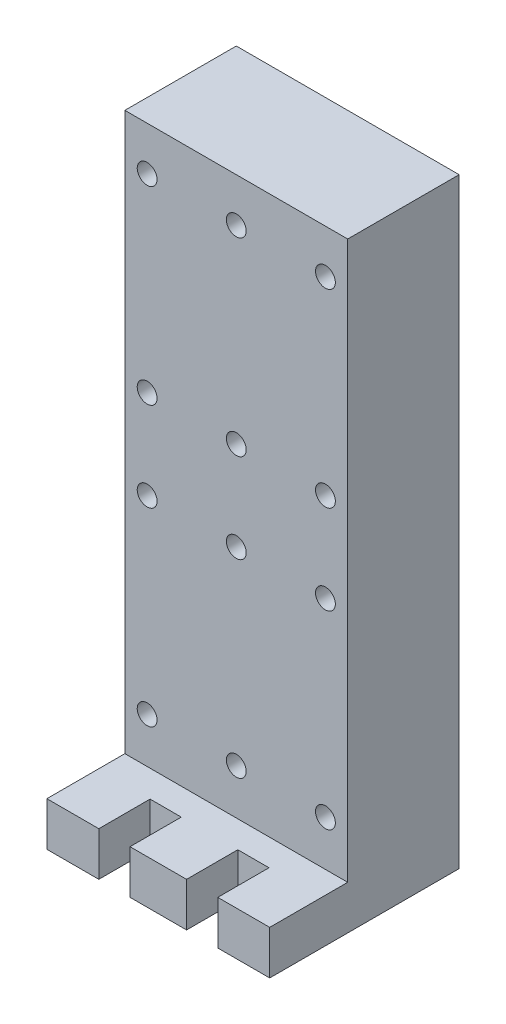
ISO-10303-21;
HEADER;
FILE_DESCRIPTION(('STEP AP214'),'2;1');
FILE_NAME('part.step','',(''),(''),'','','');
FILE_SCHEMA(('AUTOMOTIVE_DESIGN { 1 0 10303 214 1 1 1 1 }'));
ENDSEC;
DATA;
#1=APPLICATION_CONTEXT('core data for automotive mechanical design processes');
#2=APPLICATION_PROTOCOL_DEFINITION('international standard','automotive_design',2000,#1);
#3=PRODUCT_CONTEXT('',#1,'mechanical');
#4=PRODUCT('Part','Part','',(#3));
#5=PRODUCT_RELATED_PRODUCT_CATEGORY('part','',(#4));
#6=PRODUCT_DEFINITION_FORMATION('','',#4);
#7=PRODUCT_DEFINITION_CONTEXT('part definition',#1,'design');
#8=PRODUCT_DEFINITION('design','',#6,#7);
#9=PRODUCT_DEFINITION_SHAPE('','',#8);
#10=(LENGTH_UNIT() NAMED_UNIT(*) SI_UNIT(.MILLI.,.METRE.));
#11=(NAMED_UNIT(*) PLANE_ANGLE_UNIT() SI_UNIT($,.RADIAN.));
#12=(NAMED_UNIT(*) SI_UNIT($,.STERADIAN.) SOLID_ANGLE_UNIT());
#13=UNCERTAINTY_MEASURE_WITH_UNIT(LENGTH_MEASURE(1.E-05),#10,'distance_accuracy_value','');
#14=(GEOMETRIC_REPRESENTATION_CONTEXT(3) GLOBAL_UNCERTAINTY_ASSIGNED_CONTEXT((#13)) GLOBAL_UNIT_ASSIGNED_CONTEXT((#10,
#11,#12)) REPRESENTATION_CONTEXT('',''));
#15=CARTESIAN_POINT('',(0.,0.,0.));
#16=DIRECTION('',(0.,0.,1.));
#17=DIRECTION('',(1.,0.,0.));
#18=AXIS2_PLACEMENT_3D('',#15,#16,#17);
#19=CARTESIAN_POINT('',(0.,5.,0.));
#20=DIRECTION('',(0.,0.,-1.));
#21=DIRECTION('',(-1.,0.,0.));
#22=AXIS2_PLACEMENT_3D('',#19,#20,#21);
#23=PLANE('',#22);
#24=DIRECTION('',(1.,0.,0.));
#25=VECTOR('',#24,1.);
#26=CARTESIAN_POINT('',(0.,5.,0.));
#27=LINE('',#26,#25);
#28=CARTESIAN_POINT('',(9.47801,5.,0.));
#29=VERTEX_POINT('',#28);
#30=CARTESIAN_POINT('',(15.92199,5.,0.));
#31=VERTEX_POINT('',#30);
#32=EDGE_CURVE('E296',#29,#31,#27,.T.);
#33=ORIENTED_EDGE('',*,*,#32,.F.);
#34=DIRECTION('',(0.,1.,0.));
#35=VECTOR('',#34,1.);
#36=CARTESIAN_POINT('',(9.47801,0.,0.));
#37=LINE('',#36,#35);
#38=CARTESIAN_POINT('',(9.47801,0.,0.));
#39=VERTEX_POINT('',#38);
#40=EDGE_CURVE('E164',#39,#29,#37,.T.);
#41=ORIENTED_EDGE('',*,*,#40,.F.);
#42=DIRECTION('',(1.,0.,0.));
#43=VECTOR('',#42,1.);
#44=CARTESIAN_POINT('',(0.,0.,0.));
#45=LINE('',#44,#43);
#46=CARTESIAN_POINT('',(15.92199,0.,0.));
#47=VERTEX_POINT('',#46);
#48=EDGE_CURVE('E58',#39,#47,#45,.T.);
#49=ORIENTED_EDGE('',*,*,#48,.T.);
#50=DIRECTION('',(0.,1.,0.));
#51=VECTOR('',#50,1.);
#52=CARTESIAN_POINT('',(15.92199,0.,0.));
#53=LINE('',#52,#51);
#54=EDGE_CURVE('E193',#47,#31,#53,.T.);
#55=ORIENTED_EDGE('',*,*,#54,.T.);
#56=EDGE_LOOP('',(#33,#41,#49,#55));
#57=FACE_BOUND('',#56,.T.);
#58=ADVANCED_FACE('F35',(#57),#23,.F.);
#59=CARTESIAN_POINT('',(19.47799,5.,0.));
#60=VERTEX_POINT('',#59);
#61=CARTESIAN_POINT('',(25.4,5.,0.));
#62=VERTEX_POINT('',#61);
#63=EDGE_CURVE('E290',#60,#62,#27,.T.);
#64=ORIENTED_EDGE('',*,*,#63,.F.);
#65=DIRECTION('',(0.,1.,0.));
#66=VECTOR('',#65,1.);
#67=CARTESIAN_POINT('',(19.47799,0.,0.));
#68=LINE('',#67,#66);
#69=CARTESIAN_POINT('',(19.47799,0.,0.));
#70=VERTEX_POINT('',#69);
#71=EDGE_CURVE('E191',#70,#60,#68,.T.);
#72=ORIENTED_EDGE('',*,*,#71,.F.);
#73=CARTESIAN_POINT('',(25.4,0.,0.));
#74=VERTEX_POINT('',#73);
#75=EDGE_CURVE('E301',#70,#74,#45,.T.);
#76=ORIENTED_EDGE('',*,*,#75,.T.);
#77=DIRECTION('',(0.,-1.,0.));
#78=VECTOR('',#77,1.);
#79=CARTESIAN_POINT('',(25.4,5.,0.));
#80=LINE('',#79,#78);
#81=EDGE_CURVE('E43',#62,#74,#80,.T.);
#82=ORIENTED_EDGE('',*,*,#81,.F.);
#83=EDGE_LOOP('',(#64,#72,#76,#82));
#84=FACE_BOUND('',#83,.T.);
#85=ADVANCED_FACE('F354',(#84),#23,.F.);
#86=CARTESIAN_POINT('',(0.,5.,0.));
#87=DIRECTION('',(0.,-1.,0.));
#88=DIRECTION('',(0.,0.,-1.));
#89=AXIS2_PLACEMENT_3D('',#86,#87,#88);
#90=PLANE('',#89);
#91=DIRECTION('',(-1.,0.,0.));
#92=VECTOR('',#91,1.);
#93=CARTESIAN_POINT('',(5.92201,5.,-5.842));
#94=LINE('',#93,#92);
#95=CARTESIAN_POINT('',(9.47801,5.,-5.842));
#96=VERTEX_POINT('',#95);
#97=CARTESIAN_POINT('',(5.92201,5.,-5.842));
#98=VERTEX_POINT('',#97);
#99=EDGE_CURVE('E158',#96,#98,#94,.T.);
#100=ORIENTED_EDGE('',*,*,#99,.F.);
#101=DIRECTION('',(0.,0.,-1.));
#102=VECTOR('',#101,1.);
#103=CARTESIAN_POINT('',(9.47801,5.,-5.842));
#104=LINE('',#103,#102);
#105=EDGE_CURVE('E143',#29,#96,#104,.T.);
#106=ORIENTED_EDGE('',*,*,#105,.F.);
#107=ORIENTED_EDGE('',*,*,#32,.T.);
#108=DIRECTION('',(0.,0.,1.));
#109=VECTOR('',#108,1.);
#110=CARTESIAN_POINT('',(15.92199,5.,-5.842));
#111=LINE('',#110,#109);
#112=CARTESIAN_POINT('',(15.92199,5.,-5.842));
#113=VERTEX_POINT('',#112);
#114=EDGE_CURVE('E183',#113,#31,#111,.T.);
#115=ORIENTED_EDGE('',*,*,#114,.F.);
#116=DIRECTION('',(-1.,0.,0.));
#117=VECTOR('',#116,1.);
#118=CARTESIAN_POINT('',(15.92199,5.,-5.842));
#119=LINE('',#118,#117);
#120=CARTESIAN_POINT('',(19.47799,5.,-5.842));
#121=VERTEX_POINT('',#120);
#122=EDGE_CURVE('E166',#121,#113,#119,.T.);
#123=ORIENTED_EDGE('',*,*,#122,.F.);
#124=DIRECTION('',(0.,0.,-1.));
#125=VECTOR('',#124,1.);
#126=CARTESIAN_POINT('',(19.47799,5.,-5.842));
#127=LINE('',#126,#125);
#128=EDGE_CURVE('E175',#60,#121,#127,.T.);
#129=ORIENTED_EDGE('',*,*,#128,.F.);
#130=ORIENTED_EDGE('',*,*,#63,.T.);
#131=DIRECTION('',(0.,0.,-1.));
#132=VECTOR('',#131,1.);
#133=CARTESIAN_POINT('',(25.4,5.,0.));
#134=LINE('',#133,#132);
#135=CARTESIAN_POINT('',(25.4,5.,-8.89));
#136=VERTEX_POINT('',#135);
#137=EDGE_CURVE('E295',#62,#136,#134,.T.);
#138=ORIENTED_EDGE('',*,*,#137,.T.);
#139=DIRECTION('',(1.,0.,0.));
#140=VECTOR('',#139,1.);
#141=CARTESIAN_POINT('',(0.,5.,-8.89));
#142=LINE('',#141,#140);
#143=CARTESIAN_POINT('',(0.,5.,-8.89));
#144=VERTEX_POINT('',#143);
#145=EDGE_CURVE('E267',#144,#136,#142,.T.);
#146=ORIENTED_EDGE('',*,*,#145,.F.);
#147=DIRECTION('',(0.,0.,1.));
#148=VECTOR('',#147,1.);
#149=CARTESIAN_POINT('',(0.,5.,0.));
#150=LINE('',#149,#148);
#151=CARTESIAN_POINT('',(0.,5.,0.));
#152=VERTEX_POINT('',#151);
#153=EDGE_CURVE('E288',#144,#152,#150,.T.);
#154=ORIENTED_EDGE('',*,*,#153,.T.);
#155=CARTESIAN_POINT('',(5.92201,5.,0.));
#156=VERTEX_POINT('',#155);
#157=EDGE_CURVE('E292',#152,#156,#27,.T.);
#158=ORIENTED_EDGE('',*,*,#157,.T.);
#159=DIRECTION('',(0.,0.,1.));
#160=VECTOR('',#159,1.);
#161=CARTESIAN_POINT('',(5.92201,5.,-5.842));
#162=LINE('',#161,#160);
#163=EDGE_CURVE('E156',#98,#156,#162,.T.);
#164=ORIENTED_EDGE('',*,*,#163,.F.);
#165=EDGE_LOOP('',(#100,#106,#107,#115,#123,#129,#130,#138,#146,#154,#158,#164));
#166=FACE_BOUND('',#165,.T.);
#167=ADVANCED_FACE('F338',(#166),#90,.F.);
#168=CARTESIAN_POINT('',(0.,5.,0.));
#169=DIRECTION('',(1.,0.,0.));
#170=DIRECTION('',(0.,0.,-1.));
#171=AXIS2_PLACEMENT_3D('',#168,#169,#170);
#172=PLANE('',#171);
#173=DIRECTION('',(0.,0.,1.));
#174=VECTOR('',#173,1.);
#175=CARTESIAN_POINT('',(0.,0.,0.));
#176=LINE('',#175,#174);
#177=CARTESIAN_POINT('',(0.,0.,-21.59));
#178=VERTEX_POINT('',#177);
#179=CARTESIAN_POINT('',(0.,0.,0.));
#180=VERTEX_POINT('',#179);
#181=EDGE_CURVE('E287',#178,#180,#176,.T.);
#182=ORIENTED_EDGE('',*,*,#181,.T.);
#183=DIRECTION('',(0.,-1.,0.));
#184=VECTOR('',#183,1.);
#185=CARTESIAN_POINT('',(0.,5.,0.));
#186=LINE('',#185,#184);
#187=EDGE_CURVE('E11',#152,#180,#186,.T.);
#188=ORIENTED_EDGE('',*,*,#187,.F.);
#189=ORIENTED_EDGE('',*,*,#153,.F.);
#190=DIRECTION('',(0.,-1.,0.));
#191=VECTOR('',#190,1.);
#192=CARTESIAN_POINT('',(0.,68.5,-8.89));
#193=LINE('',#192,#191);
#194=CARTESIAN_POINT('',(0.,68.5,-8.89));
#195=VERTEX_POINT('',#194);
#196=EDGE_CURVE('E284',#195,#144,#193,.T.);
#197=ORIENTED_EDGE('',*,*,#196,.F.);
#198=DIRECTION('',(0.,0.,1.));
#199=VECTOR('',#198,1.);
#200=CARTESIAN_POINT('',(0.,68.5,-21.59));
#201=LINE('',#200,#199);
#202=CARTESIAN_POINT('',(0.,68.5,-21.59));
#203=VERTEX_POINT('',#202);
#204=EDGE_CURVE('E268',#203,#195,#201,.T.);
#205=ORIENTED_EDGE('',*,*,#204,.F.);
#206=DIRECTION('',(0.,-1.,0.));
#207=VECTOR('',#206,1.);
#208=CARTESIAN_POINT('',(0.,5.,-21.59));
#209=LINE('',#208,#207);
#210=EDGE_CURVE('E298',#203,#178,#209,.T.);
#211=ORIENTED_EDGE('',*,*,#210,.T.);
#212=EDGE_LOOP('',(#182,#188,#189,#197,#205,#211));
#213=FACE_BOUND('',#212,.T.);
#214=ADVANCED_FACE('F37',(#213),#172,.F.);
#215=CARTESIAN_POINT('',(5.92201,0.,0.));
#216=VERTEX_POINT('',#215);
#217=EDGE_CURVE('E302',#180,#216,#45,.T.);
#218=ORIENTED_EDGE('',*,*,#217,.T.);
#219=DIRECTION('',(0.,1.,0.));
#220=VECTOR('',#219,1.);
#221=CARTESIAN_POINT('',(5.92201,0.,0.));
#222=LINE('',#221,#220);
#223=EDGE_CURVE('E167',#216,#156,#222,.T.);
#224=ORIENTED_EDGE('',*,*,#223,.T.);
#225=ORIENTED_EDGE('',*,*,#157,.F.);
#226=ORIENTED_EDGE('',*,*,#187,.T.);
#227=EDGE_LOOP('',(#218,#224,#225,#226));
#228=FACE_BOUND('',#227,.T.);
#229=ADVANCED_FACE('F341',(#228),#23,.F.);
#230=CARTESIAN_POINT('',(25.4,5.,0.));
#231=DIRECTION('',(-1.,0.,0.));
#232=DIRECTION('',(0.,0.,1.));
#233=AXIS2_PLACEMENT_3D('',#230,#231,#232);
#234=PLANE('',#233);
#235=DIRECTION('',(0.,0.,-1.));
#236=VECTOR('',#235,1.);
#237=CARTESIAN_POINT('',(25.4,0.,0.));
#238=LINE('',#237,#236);
#239=CARTESIAN_POINT('',(25.4,0.,-21.59));
#240=VERTEX_POINT('',#239);
#241=EDGE_CURVE('E305',#74,#240,#238,.T.);
#242=ORIENTED_EDGE('',*,*,#241,.T.);
#243=DIRECTION('',(0.,-1.,0.));
#244=VECTOR('',#243,1.);
#245=CARTESIAN_POINT('',(25.4,5.,-21.59));
#246=LINE('',#245,#244);
#247=CARTESIAN_POINT('',(25.4,68.5,-21.59));
#248=VERTEX_POINT('',#247);
#249=EDGE_CURVE('E310',#248,#240,#246,.T.);
#250=ORIENTED_EDGE('',*,*,#249,.F.);
#251=DIRECTION('',(0.,0.,-1.));
#252=VECTOR('',#251,1.);
#253=CARTESIAN_POINT('',(25.4,68.5,-21.59));
#254=LINE('',#253,#252);
#255=CARTESIAN_POINT('',(25.4,68.5,-8.89));
#256=VERTEX_POINT('',#255);
#257=EDGE_CURVE('E273',#256,#248,#254,.T.);
#258=ORIENTED_EDGE('',*,*,#257,.F.);
#259=DIRECTION('',(0.,-1.,0.));
#260=VECTOR('',#259,1.);
#261=CARTESIAN_POINT('',(25.4,68.5,-8.89));
#262=LINE('',#261,#260);
#263=EDGE_CURVE('E279',#256,#136,#262,.T.);
#264=ORIENTED_EDGE('',*,*,#263,.T.);
#265=ORIENTED_EDGE('',*,*,#137,.F.);
#266=ORIENTED_EDGE('',*,*,#81,.T.);
#267=EDGE_LOOP('',(#242,#250,#258,#264,#265,#266));
#268=FACE_BOUND('',#267,.T.);
#269=ADVANCED_FACE('F317',(#268),#234,.F.);
#270=CARTESIAN_POINT('',(0.,5.,-21.59));
#271=DIRECTION('',(0.,0.,1.));
#272=DIRECTION('',(1.,0.,0.));
#273=AXIS2_PLACEMENT_3D('',#270,#271,#272);
#274=PLANE('',#273);
#275=CARTESIAN_POINT('',(2.54,63.5,-21.59));
#276=DIRECTION('',(0.,0.,1.));
#277=DIRECTION('',(1.,0.,0.));
#278=AXIS2_PLACEMENT_3D('',#275,#276,#277);
#279=CIRCLE('',#278,1.1303);
#280=CARTESIAN_POINT('',(3.6703,63.5,-21.59));
#281=VERTEX_POINT('',#280);
#282=EDGE_CURVE('E198',#281,#281,#279,.T.);
#283=ORIENTED_EDGE('',*,*,#282,.T.);
#284=EDGE_LOOP('',(#283));
#285=FACE_BOUND('',#284,.T.);
#286=CARTESIAN_POINT('',(12.7,63.5,-21.59));
#287=DIRECTION('',(0.,0.,1.));
#288=DIRECTION('',(1.,0.,0.));
#289=AXIS2_PLACEMENT_3D('',#286,#287,#288);
#290=CIRCLE('',#289,1.1303);
#291=CARTESIAN_POINT('',(13.8303,63.5,-21.59));
#292=VERTEX_POINT('',#291);
#293=EDGE_CURVE('E204',#292,#292,#290,.T.);
#294=ORIENTED_EDGE('',*,*,#293,.T.);
#295=EDGE_LOOP('',(#294));
#296=FACE_BOUND('',#295,.T.);
#297=CARTESIAN_POINT('',(22.86,63.5,-21.59));
#298=DIRECTION('',(0.,0.,1.));
#299=DIRECTION('',(1.,0.,0.));
#300=AXIS2_PLACEMENT_3D('',#297,#298,#299);
#301=CIRCLE('',#300,1.1303);
#302=CARTESIAN_POINT('',(23.9903,63.5,-21.59));
#303=VERTEX_POINT('',#302);
#304=EDGE_CURVE('E210',#303,#303,#301,.T.);
#305=ORIENTED_EDGE('',*,*,#304,.T.);
#306=EDGE_LOOP('',(#305));
#307=FACE_BOUND('',#306,.T.);
#308=CARTESIAN_POINT('',(2.54,41.91,-21.59));
#309=DIRECTION('',(0.,0.,1.));
#310=DIRECTION('',(1.,0.,0.));
#311=AXIS2_PLACEMENT_3D('',#308,#309,#310);
#312=CIRCLE('',#311,1.1303);
#313=CARTESIAN_POINT('',(3.6703,41.91,-21.59));
#314=VERTEX_POINT('',#313);
#315=EDGE_CURVE('E216',#314,#314,#312,.T.);
#316=ORIENTED_EDGE('',*,*,#315,.T.);
#317=EDGE_LOOP('',(#316));
#318=FACE_BOUND('',#317,.T.);
#319=CARTESIAN_POINT('',(12.7,41.91,-21.59));
#320=DIRECTION('',(0.,0.,1.));
#321=DIRECTION('',(1.,0.,0.));
#322=AXIS2_PLACEMENT_3D('',#319,#320,#321);
#323=CIRCLE('',#322,1.1303);
#324=CARTESIAN_POINT('',(13.8303,41.91,-21.59));
#325=VERTEX_POINT('',#324);
#326=EDGE_CURVE('E222',#325,#325,#323,.T.);
#327=ORIENTED_EDGE('',*,*,#326,.T.);
#328=EDGE_LOOP('',(#327));
#329=FACE_BOUND('',#328,.T.);
#330=CARTESIAN_POINT('',(22.86,41.91,-21.59));
#331=DIRECTION('',(0.,0.,1.));
#332=DIRECTION('',(1.,0.,0.));
#333=AXIS2_PLACEMENT_3D('',#330,#331,#332);
#334=CIRCLE('',#333,1.1303);
#335=CARTESIAN_POINT('',(23.9903,41.91,-21.59));
#336=VERTEX_POINT('',#335);
#337=EDGE_CURVE('E228',#336,#336,#334,.T.);
#338=ORIENTED_EDGE('',*,*,#337,.T.);
#339=EDGE_LOOP('',(#338));
#340=FACE_BOUND('',#339,.T.);
#341=CARTESIAN_POINT('',(2.54,31.75,-21.59));
#342=DIRECTION('',(0.,0.,1.));
#343=DIRECTION('',(1.,0.,0.));
#344=AXIS2_PLACEMENT_3D('',#341,#342,#343);
#345=CIRCLE('',#344,1.1303);
#346=CARTESIAN_POINT('',(3.6703,31.75,-21.59));
#347=VERTEX_POINT('',#346);
#348=EDGE_CURVE('E234',#347,#347,#345,.T.);
#349=ORIENTED_EDGE('',*,*,#348,.T.);
#350=EDGE_LOOP('',(#349));
#351=FACE_BOUND('',#350,.T.);
#352=CARTESIAN_POINT('',(12.7,31.75,-21.59));
#353=DIRECTION('',(0.,0.,1.));
#354=DIRECTION('',(1.,0.,0.));
#355=AXIS2_PLACEMENT_3D('',#352,#353,#354);
#356=CIRCLE('',#355,1.1303);
#357=CARTESIAN_POINT('',(13.8303,31.75,-21.59));
#358=VERTEX_POINT('',#357);
#359=EDGE_CURVE('E240',#358,#358,#356,.T.);
#360=ORIENTED_EDGE('',*,*,#359,.T.);
#361=EDGE_LOOP('',(#360));
#362=FACE_BOUND('',#361,.T.);
#363=CARTESIAN_POINT('',(22.86,31.75,-21.59));
#364=DIRECTION('',(0.,0.,1.));
#365=DIRECTION('',(1.,0.,0.));
#366=AXIS2_PLACEMENT_3D('',#363,#364,#365);
#367=CIRCLE('',#366,1.1303);
#368=CARTESIAN_POINT('',(23.9903,31.75,-21.59));
#369=VERTEX_POINT('',#368);
#370=EDGE_CURVE('E246',#369,#369,#367,.T.);
#371=ORIENTED_EDGE('',*,*,#370,.T.);
#372=EDGE_LOOP('',(#371));
#373=FACE_BOUND('',#372,.T.);
#374=CARTESIAN_POINT('',(2.54,10.16,-21.59));
#375=DIRECTION('',(0.,0.,1.));
#376=DIRECTION('',(1.,0.,0.));
#377=AXIS2_PLACEMENT_3D('',#374,#375,#376);
#378=CIRCLE('',#377,1.1303);
#379=CARTESIAN_POINT('',(3.6703,10.16,-21.59));
#380=VERTEX_POINT('',#379);
#381=EDGE_CURVE('E252',#380,#380,#378,.T.);
#382=ORIENTED_EDGE('',*,*,#381,.T.);
#383=EDGE_LOOP('',(#382));
#384=FACE_BOUND('',#383,.T.);
#385=CARTESIAN_POINT('',(12.7,10.16,-21.59));
#386=DIRECTION('',(0.,0.,1.));
#387=DIRECTION('',(1.,0.,0.));
#388=AXIS2_PLACEMENT_3D('',#385,#386,#387);
#389=CIRCLE('',#388,1.1303);
#390=CARTESIAN_POINT('',(13.8303,10.16,-21.59));
#391=VERTEX_POINT('',#390);
#392=EDGE_CURVE('E258',#391,#391,#389,.T.);
#393=ORIENTED_EDGE('',*,*,#392,.T.);
#394=EDGE_LOOP('',(#393));
#395=FACE_BOUND('',#394,.T.);
#396=CARTESIAN_POINT('',(22.86,10.16,-21.59));
#397=DIRECTION('',(0.,0.,1.));
#398=DIRECTION('',(1.,0.,0.));
#399=AXIS2_PLACEMENT_3D('',#396,#397,#398);
#400=CIRCLE('',#399,1.1303);
#401=CARTESIAN_POINT('',(23.9903,10.16,-21.59));
#402=VERTEX_POINT('',#401);
#403=EDGE_CURVE('E264',#402,#402,#400,.T.);
#404=ORIENTED_EDGE('',*,*,#403,.T.);
#405=EDGE_LOOP('',(#404));
#406=FACE_BOUND('',#405,.T.);
#407=DIRECTION('',(-1.,0.,0.));
#408=VECTOR('',#407,1.);
#409=CARTESIAN_POINT('',(0.,0.,-21.59));
#410=LINE('',#409,#408);
#411=EDGE_CURVE('E291',#240,#178,#410,.T.);
#412=ORIENTED_EDGE('',*,*,#411,.T.);
#413=ORIENTED_EDGE('',*,*,#210,.F.);
#414=DIRECTION('',(-1.,0.,0.));
#415=VECTOR('',#414,1.);
#416=CARTESIAN_POINT('',(0.,68.5,-21.59));
#417=LINE('',#416,#415);
#418=EDGE_CURVE('E276',#248,#203,#417,.T.);
#419=ORIENTED_EDGE('',*,*,#418,.F.);
#420=ORIENTED_EDGE('',*,*,#249,.T.);
#421=EDGE_LOOP('',(#412,#413,#419,#420));
#422=FACE_BOUND('',#421,.T.);
#423=ADVANCED_FACE('F324',(#285,#296,#307,#318,#329,#340,#351,#362,#373,#384,#395,#406,#422),
#274,.F.);
#424=CARTESIAN_POINT('',(0.,0.,0.));
#425=DIRECTION('',(0.,-1.,0.));
#426=DIRECTION('',(0.,0.,-1.));
#427=AXIS2_PLACEMENT_3D('',#424,#425,#426);
#428=PLANE('',#427);
#429=DIRECTION('',(0.,0.,-1.));
#430=VECTOR('',#429,1.);
#431=CARTESIAN_POINT('',(9.47801,0.,-5.842));
#432=LINE('',#431,#430);
#433=CARTESIAN_POINT('',(9.47801,0.,-5.842));
#434=VERTEX_POINT('',#433);
#435=EDGE_CURVE('E141',#39,#434,#432,.T.);
#436=ORIENTED_EDGE('',*,*,#435,.T.);
#437=DIRECTION('',(-1.,0.,0.));
#438=VECTOR('',#437,1.);
#439=CARTESIAN_POINT('',(5.92201,0.,-5.842));
#440=LINE('',#439,#438);
#441=CARTESIAN_POINT('',(5.92201,0.,-5.842));
#442=VERTEX_POINT('',#441);
#443=EDGE_CURVE('E150',#434,#442,#440,.T.);
#444=ORIENTED_EDGE('',*,*,#443,.T.);
#445=DIRECTION('',(0.,0.,1.));
#446=VECTOR('',#445,1.);
#447=CARTESIAN_POINT('',(5.92201,0.,-5.842));
#448=LINE('',#447,#446);
#449=EDGE_CURVE('E50',#442,#216,#448,.T.);
#450=ORIENTED_EDGE('',*,*,#449,.T.);
#451=ORIENTED_EDGE('',*,*,#217,.F.);
#452=ORIENTED_EDGE('',*,*,#181,.F.);
#453=ORIENTED_EDGE('',*,*,#411,.F.);
#454=ORIENTED_EDGE('',*,*,#241,.F.);
#455=ORIENTED_EDGE('',*,*,#75,.F.);
#456=DIRECTION('',(0.,0.,-1.));
#457=VECTOR('',#456,1.);
#458=CARTESIAN_POINT('',(19.47799,0.,-5.842));
#459=LINE('',#458,#457);
#460=CARTESIAN_POINT('',(19.47799,0.,-5.842));
#461=VERTEX_POINT('',#460);
#462=EDGE_CURVE('E177',#70,#461,#459,.T.);
#463=ORIENTED_EDGE('',*,*,#462,.T.);
#464=DIRECTION('',(-1.,0.,0.));
#465=VECTOR('',#464,1.);
#466=CARTESIAN_POINT('',(15.92199,0.,-5.842));
#467=LINE('',#466,#465);
#468=CARTESIAN_POINT('',(15.92199,0.,-5.842));
#469=VERTEX_POINT('',#468);
#470=EDGE_CURVE('E171',#461,#469,#467,.T.);
#471=ORIENTED_EDGE('',*,*,#470,.T.);
#472=DIRECTION('',(0.,0.,1.));
#473=VECTOR('',#472,1.);
#474=CARTESIAN_POINT('',(15.92199,0.,-5.842));
#475=LINE('',#474,#473);
#476=EDGE_CURVE('E174',#469,#47,#475,.T.);
#477=ORIENTED_EDGE('',*,*,#476,.T.);
#478=ORIENTED_EDGE('',*,*,#48,.F.);
#479=EDGE_LOOP('',(#436,#444,#450,#451,#452,#453,#454,#455,#463,#471,#477,#478));
#480=FACE_BOUND('',#479,.T.);
#481=ADVANCED_FACE('F154',(#480),#428,.T.);
#482=CARTESIAN_POINT('',(0.,68.5,-8.89));
#483=DIRECTION('',(0.,0.,-1.));
#484=DIRECTION('',(-1.,0.,0.));
#485=AXIS2_PLACEMENT_3D('',#482,#483,#484);
#486=PLANE('',#485);
#487=CARTESIAN_POINT('',(2.54,63.5,-8.89));
#488=DIRECTION('',(0.,0.,1.));
#489=DIRECTION('',(1.,0.,0.));
#490=AXIS2_PLACEMENT_3D('',#487,#488,#489);
#491=CIRCLE('',#490,1.13029999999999);
#492=CARTESIAN_POINT('',(3.67029999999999,63.5,-8.89));
#493=VERTEX_POINT('',#492);
#494=EDGE_CURVE('E190',#493,#493,#491,.T.);
#495=ORIENTED_EDGE('',*,*,#494,.F.);
#496=EDGE_LOOP('',(#495));
#497=FACE_BOUND('',#496,.T.);
#498=CARTESIAN_POINT('',(12.7,63.5,-8.89));
#499=DIRECTION('',(0.,0.,1.));
#500=DIRECTION('',(1.,0.,0.));
#501=AXIS2_PLACEMENT_3D('',#498,#499,#500);
#502=CIRCLE('',#501,1.13029999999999);
#503=CARTESIAN_POINT('',(13.8303,63.5,-8.89));
#504=VERTEX_POINT('',#503);
#505=EDGE_CURVE('E201',#504,#504,#502,.T.);
#506=ORIENTED_EDGE('',*,*,#505,.F.);
#507=EDGE_LOOP('',(#506));
#508=FACE_BOUND('',#507,.T.);
#509=CARTESIAN_POINT('',(22.86,63.5,-8.89));
#510=DIRECTION('',(0.,0.,1.));
#511=DIRECTION('',(1.,0.,0.));
#512=AXIS2_PLACEMENT_3D('',#509,#510,#511);
#513=CIRCLE('',#512,1.13029999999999);
#514=CARTESIAN_POINT('',(23.9903,63.5,-8.89));
#515=VERTEX_POINT('',#514);
#516=EDGE_CURVE('E207',#515,#515,#513,.T.);
#517=ORIENTED_EDGE('',*,*,#516,.F.);
#518=EDGE_LOOP('',(#517));
#519=FACE_BOUND('',#518,.T.);
#520=CARTESIAN_POINT('',(2.54,41.91,-8.89));
#521=DIRECTION('',(0.,0.,1.));
#522=DIRECTION('',(1.,0.,0.));
#523=AXIS2_PLACEMENT_3D('',#520,#521,#522);
#524=CIRCLE('',#523,1.13029999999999);
#525=CARTESIAN_POINT('',(3.67029999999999,41.91,-8.89));
#526=VERTEX_POINT('',#525);
#527=EDGE_CURVE('E213',#526,#526,#524,.T.);
#528=ORIENTED_EDGE('',*,*,#527,.F.);
#529=EDGE_LOOP('',(#528));
#530=FACE_BOUND('',#529,.T.);
#531=CARTESIAN_POINT('',(12.7,41.91,-8.89));
#532=DIRECTION('',(0.,0.,1.));
#533=DIRECTION('',(1.,0.,0.));
#534=AXIS2_PLACEMENT_3D('',#531,#532,#533);
#535=CIRCLE('',#534,1.13029999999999);
#536=CARTESIAN_POINT('',(13.8303,41.91,-8.89));
#537=VERTEX_POINT('',#536);
#538=EDGE_CURVE('E219',#537,#537,#535,.T.);
#539=ORIENTED_EDGE('',*,*,#538,.F.);
#540=EDGE_LOOP('',(#539));
#541=FACE_BOUND('',#540,.T.);
#542=CARTESIAN_POINT('',(22.86,41.91,-8.89));
#543=DIRECTION('',(0.,0.,1.));
#544=DIRECTION('',(1.,0.,0.));
#545=AXIS2_PLACEMENT_3D('',#542,#543,#544);
#546=CIRCLE('',#545,1.13029999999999);
#547=CARTESIAN_POINT('',(23.9903,41.91,-8.89));
#548=VERTEX_POINT('',#547);
#549=EDGE_CURVE('E225',#548,#548,#546,.T.);
#550=ORIENTED_EDGE('',*,*,#549,.F.);
#551=EDGE_LOOP('',(#550));
#552=FACE_BOUND('',#551,.T.);
#553=CARTESIAN_POINT('',(2.54,31.75,-8.89));
#554=DIRECTION('',(0.,0.,1.));
#555=DIRECTION('',(1.,0.,0.));
#556=AXIS2_PLACEMENT_3D('',#553,#554,#555);
#557=CIRCLE('',#556,1.13029999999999);
#558=CARTESIAN_POINT('',(3.67029999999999,31.75,-8.89));
#559=VERTEX_POINT('',#558);
#560=EDGE_CURVE('E231',#559,#559,#557,.T.);
#561=ORIENTED_EDGE('',*,*,#560,.F.);
#562=EDGE_LOOP('',(#561));
#563=FACE_BOUND('',#562,.T.);
#564=CARTESIAN_POINT('',(12.7,31.75,-8.89));
#565=DIRECTION('',(0.,0.,1.));
#566=DIRECTION('',(1.,0.,0.));
#567=AXIS2_PLACEMENT_3D('',#564,#565,#566);
#568=CIRCLE('',#567,1.13029999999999);
#569=CARTESIAN_POINT('',(13.8303,31.75,-8.89));
#570=VERTEX_POINT('',#569);
#571=EDGE_CURVE('E237',#570,#570,#568,.T.);
#572=ORIENTED_EDGE('',*,*,#571,.F.);
#573=EDGE_LOOP('',(#572));
#574=FACE_BOUND('',#573,.T.);
#575=CARTESIAN_POINT('',(22.86,31.75,-8.89));
#576=DIRECTION('',(0.,0.,1.));
#577=DIRECTION('',(1.,0.,0.));
#578=AXIS2_PLACEMENT_3D('',#575,#576,#577);
#579=CIRCLE('',#578,1.13029999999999);
#580=CARTESIAN_POINT('',(23.9903,31.75,-8.89));
#581=VERTEX_POINT('',#580);
#582=EDGE_CURVE('E243',#581,#581,#579,.T.);
#583=ORIENTED_EDGE('',*,*,#582,.F.);
#584=EDGE_LOOP('',(#583));
#585=FACE_BOUND('',#584,.T.);
#586=CARTESIAN_POINT('',(2.54,10.16,-8.89));
#587=DIRECTION('',(0.,0.,1.));
#588=DIRECTION('',(1.,0.,0.));
#589=AXIS2_PLACEMENT_3D('',#586,#587,#588);
#590=CIRCLE('',#589,1.13029999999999);
#591=CARTESIAN_POINT('',(3.67029999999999,10.16,-8.89));
#592=VERTEX_POINT('',#591);
#593=EDGE_CURVE('E249',#592,#592,#590,.T.);
#594=ORIENTED_EDGE('',*,*,#593,.F.);
#595=EDGE_LOOP('',(#594));
#596=FACE_BOUND('',#595,.T.);
#597=CARTESIAN_POINT('',(12.7,10.16,-8.89));
#598=DIRECTION('',(0.,0.,1.));
#599=DIRECTION('',(1.,0.,0.));
#600=AXIS2_PLACEMENT_3D('',#597,#598,#599);
#601=CIRCLE('',#600,1.13029999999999);
#602=CARTESIAN_POINT('',(13.8303,10.16,-8.89));
#603=VERTEX_POINT('',#602);
#604=EDGE_CURVE('E255',#603,#603,#601,.T.);
#605=ORIENTED_EDGE('',*,*,#604,.F.);
#606=EDGE_LOOP('',(#605));
#607=FACE_BOUND('',#606,.T.);
#608=CARTESIAN_POINT('',(22.86,10.16,-8.89));
#609=DIRECTION('',(0.,0.,1.));
#610=DIRECTION('',(1.,0.,0.));
#611=AXIS2_PLACEMENT_3D('',#608,#609,#610);
#612=CIRCLE('',#611,1.13029999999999);
#613=CARTESIAN_POINT('',(23.9903,10.16,-8.89));
#614=VERTEX_POINT('',#613);
#615=EDGE_CURVE('E261',#614,#614,#612,.T.);
#616=ORIENTED_EDGE('',*,*,#615,.F.);
#617=EDGE_LOOP('',(#616));
#618=FACE_BOUND('',#617,.T.);
#619=ORIENTED_EDGE('',*,*,#145,.T.);
#620=ORIENTED_EDGE('',*,*,#263,.F.);
#621=DIRECTION('',(1.,0.,0.));
#622=VECTOR('',#621,1.);
#623=CARTESIAN_POINT('',(0.,68.5,-8.89));
#624=LINE('',#623,#622);
#625=EDGE_CURVE('E271',#195,#256,#624,.T.);
#626=ORIENTED_EDGE('',*,*,#625,.F.);
#627=ORIENTED_EDGE('',*,*,#196,.T.);
#628=EDGE_LOOP('',(#619,#620,#626,#627));
#629=FACE_BOUND('',#628,.T.);
#630=ADVANCED_FACE('F336',(#497,#508,#519,#530,#541,#552,#563,#574,#585,#596,#607,#618,#629),
#486,.F.);
#631=CARTESIAN_POINT('',(0.,68.5,0.));
#632=DIRECTION('',(0.,1.,0.));
#633=DIRECTION('',(0.,0.,1.));
#634=AXIS2_PLACEMENT_3D('',#631,#632,#633);
#635=PLANE('',#634);
#636=ORIENTED_EDGE('',*,*,#204,.T.);
#637=ORIENTED_EDGE('',*,*,#625,.T.);
#638=ORIENTED_EDGE('',*,*,#257,.T.);
#639=ORIENTED_EDGE('',*,*,#418,.T.);
#640=EDGE_LOOP('',(#636,#637,#638,#639));
#641=FACE_BOUND('',#640,.T.);
#642=ADVANCED_FACE('F332',(#641),#635,.T.);
#643=CARTESIAN_POINT('',(22.86,10.16,-8.89));
#644=DIRECTION('',(0.,0.,1.));
#645=DIRECTION('',(1.,0.,0.));
#646=AXIS2_PLACEMENT_3D('',#643,#644,#645);
#647=CYLINDRICAL_SURFACE('',#646,1.13029999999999);
#648=ORIENTED_EDGE('',*,*,#403,.F.);
#649=EDGE_LOOP('',(#648));
#650=FACE_BOUND('',#649,.T.);
#651=ORIENTED_EDGE('',*,*,#615,.T.);
#652=EDGE_LOOP('',(#651));
#653=FACE_BOUND('',#652,.T.);
#654=ADVANCED_FACE('F404',(#650,#653),#647,.F.);
#655=CARTESIAN_POINT('',(12.7,10.16,-8.89));
#656=DIRECTION('',(0.,0.,1.));
#657=DIRECTION('',(1.,0.,0.));
#658=AXIS2_PLACEMENT_3D('',#655,#656,#657);
#659=CYLINDRICAL_SURFACE('',#658,1.13029999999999);
#660=ORIENTED_EDGE('',*,*,#392,.F.);
#661=EDGE_LOOP('',(#660));
#662=FACE_BOUND('',#661,.T.);
#663=ORIENTED_EDGE('',*,*,#604,.T.);
#664=EDGE_LOOP('',(#663));
#665=FACE_BOUND('',#664,.T.);
#666=ADVANCED_FACE('F407',(#662,#665),#659,.F.);
#667=CARTESIAN_POINT('',(2.54,10.16,-8.89));
#668=DIRECTION('',(0.,0.,1.));
#669=DIRECTION('',(1.,0.,0.));
#670=AXIS2_PLACEMENT_3D('',#667,#668,#669);
#671=CYLINDRICAL_SURFACE('',#670,1.13029999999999);
#672=ORIENTED_EDGE('',*,*,#381,.F.);
#673=EDGE_LOOP('',(#672));
#674=FACE_BOUND('',#673,.T.);
#675=ORIENTED_EDGE('',*,*,#593,.T.);
#676=EDGE_LOOP('',(#675));
#677=FACE_BOUND('',#676,.T.);
#678=ADVANCED_FACE('F439',(#674,#677),#671,.F.);
#679=CARTESIAN_POINT('',(22.86,31.75,-8.89));
#680=DIRECTION('',(0.,0.,1.));
#681=DIRECTION('',(1.,0.,0.));
#682=AXIS2_PLACEMENT_3D('',#679,#680,#681);
#683=CYLINDRICAL_SURFACE('',#682,1.13029999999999);
#684=ORIENTED_EDGE('',*,*,#370,.F.);
#685=EDGE_LOOP('',(#684));
#686=FACE_BOUND('',#685,.T.);
#687=ORIENTED_EDGE('',*,*,#582,.T.);
#688=EDGE_LOOP('',(#687));
#689=FACE_BOUND('',#688,.T.);
#690=ADVANCED_FACE('F445',(#686,#689),#683,.F.);
#691=CARTESIAN_POINT('',(12.7,31.75,-8.89));
#692=DIRECTION('',(0.,0.,1.));
#693=DIRECTION('',(1.,0.,0.));
#694=AXIS2_PLACEMENT_3D('',#691,#692,#693);
#695=CYLINDRICAL_SURFACE('',#694,1.13029999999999);
#696=ORIENTED_EDGE('',*,*,#359,.F.);
#697=EDGE_LOOP('',(#696));
#698=FACE_BOUND('',#697,.T.);
#699=ORIENTED_EDGE('',*,*,#571,.T.);
#700=EDGE_LOOP('',(#699));
#701=FACE_BOUND('',#700,.T.);
#702=ADVANCED_FACE('F451',(#698,#701),#695,.F.);
#703=CARTESIAN_POINT('',(2.54,31.75,-8.89));
#704=DIRECTION('',(0.,0.,1.));
#705=DIRECTION('',(1.,0.,0.));
#706=AXIS2_PLACEMENT_3D('',#703,#704,#705);
#707=CYLINDRICAL_SURFACE('',#706,1.13029999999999);
#708=ORIENTED_EDGE('',*,*,#348,.F.);
#709=EDGE_LOOP('',(#708));
#710=FACE_BOUND('',#709,.T.);
#711=ORIENTED_EDGE('',*,*,#560,.T.);
#712=EDGE_LOOP('',(#711));
#713=FACE_BOUND('',#712,.T.);
#714=ADVANCED_FACE('F455',(#710,#713),#707,.F.);
#715=CARTESIAN_POINT('',(22.86,41.91,-8.89));
#716=DIRECTION('',(0.,0.,1.));
#717=DIRECTION('',(1.,0.,0.));
#718=AXIS2_PLACEMENT_3D('',#715,#716,#717);
#719=CYLINDRICAL_SURFACE('',#718,1.13029999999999);
#720=ORIENTED_EDGE('',*,*,#337,.F.);
#721=EDGE_LOOP('',(#720));
#722=FACE_BOUND('',#721,.T.);
#723=ORIENTED_EDGE('',*,*,#549,.T.);
#724=EDGE_LOOP('',(#723));
#725=FACE_BOUND('',#724,.T.);
#726=ADVANCED_FACE('F459',(#722,#725),#719,.F.);
#727=CARTESIAN_POINT('',(12.7,41.91,-8.89));
#728=DIRECTION('',(0.,0.,1.));
#729=DIRECTION('',(1.,0.,0.));
#730=AXIS2_PLACEMENT_3D('',#727,#728,#729);
#731=CYLINDRICAL_SURFACE('',#730,1.13029999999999);
#732=ORIENTED_EDGE('',*,*,#326,.F.);
#733=EDGE_LOOP('',(#732));
#734=FACE_BOUND('',#733,.T.);
#735=ORIENTED_EDGE('',*,*,#538,.T.);
#736=EDGE_LOOP('',(#735));
#737=FACE_BOUND('',#736,.T.);
#738=ADVANCED_FACE('F463',(#734,#737),#731,.F.);
#739=CARTESIAN_POINT('',(2.54,41.91,-8.89));
#740=DIRECTION('',(0.,0.,1.));
#741=DIRECTION('',(1.,0.,0.));
#742=AXIS2_PLACEMENT_3D('',#739,#740,#741);
#743=CYLINDRICAL_SURFACE('',#742,1.13029999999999);
#744=ORIENTED_EDGE('',*,*,#315,.F.);
#745=EDGE_LOOP('',(#744));
#746=FACE_BOUND('',#745,.T.);
#747=ORIENTED_EDGE('',*,*,#527,.T.);
#748=EDGE_LOOP('',(#747));
#749=FACE_BOUND('',#748,.T.);
#750=ADVANCED_FACE('F467',(#746,#749),#743,.F.);
#751=CARTESIAN_POINT('',(22.86,63.5,-8.89));
#752=DIRECTION('',(0.,0.,1.));
#753=DIRECTION('',(1.,0.,0.));
#754=AXIS2_PLACEMENT_3D('',#751,#752,#753);
#755=CYLINDRICAL_SURFACE('',#754,1.13029999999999);
#756=ORIENTED_EDGE('',*,*,#304,.F.);
#757=EDGE_LOOP('',(#756));
#758=FACE_BOUND('',#757,.T.);
#759=ORIENTED_EDGE('',*,*,#516,.T.);
#760=EDGE_LOOP('',(#759));
#761=FACE_BOUND('',#760,.T.);
#762=ADVANCED_FACE('F471',(#758,#761),#755,.F.);
#763=CARTESIAN_POINT('',(12.7,63.5,-8.89));
#764=DIRECTION('',(0.,0.,1.));
#765=DIRECTION('',(1.,0.,0.));
#766=AXIS2_PLACEMENT_3D('',#763,#764,#765);
#767=CYLINDRICAL_SURFACE('',#766,1.13029999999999);
#768=ORIENTED_EDGE('',*,*,#293,.F.);
#769=EDGE_LOOP('',(#768));
#770=FACE_BOUND('',#769,.T.);
#771=ORIENTED_EDGE('',*,*,#505,.T.);
#772=EDGE_LOOP('',(#771));
#773=FACE_BOUND('',#772,.T.);
#774=ADVANCED_FACE('F475',(#770,#773),#767,.F.);
#775=CARTESIAN_POINT('',(2.54,63.5,-8.89));
#776=DIRECTION('',(0.,0.,1.));
#777=DIRECTION('',(1.,0.,0.));
#778=AXIS2_PLACEMENT_3D('',#775,#776,#777);
#779=CYLINDRICAL_SURFACE('',#778,1.13029999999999);
#780=ORIENTED_EDGE('',*,*,#282,.F.);
#781=EDGE_LOOP('',(#780));
#782=FACE_BOUND('',#781,.T.);
#783=ORIENTED_EDGE('',*,*,#494,.T.);
#784=EDGE_LOOP('',(#783));
#785=FACE_BOUND('',#784,.T.);
#786=ADVANCED_FACE('F479',(#782,#785),#779,.F.);
#787=CARTESIAN_POINT('',(15.92199,0.,-5.842));
#788=DIRECTION('',(0.,0.,-1.));
#789=DIRECTION('',(-1.,0.,0.));
#790=AXIS2_PLACEMENT_3D('',#787,#788,#789);
#791=PLANE('',#790);
#792=ORIENTED_EDGE('',*,*,#122,.T.);
#793=DIRECTION('',(0.,1.,0.));
#794=VECTOR('',#793,1.);
#795=CARTESIAN_POINT('',(15.92199,0.,-5.842));
#796=LINE('',#795,#794);
#797=EDGE_CURVE('E180',#469,#113,#796,.T.);
#798=ORIENTED_EDGE('',*,*,#797,.F.);
#799=ORIENTED_EDGE('',*,*,#470,.F.);
#800=DIRECTION('',(0.,1.,0.));
#801=VECTOR('',#800,1.);
#802=CARTESIAN_POINT('',(19.47799,0.,-5.842));
#803=LINE('',#802,#801);
#804=EDGE_CURVE('E188',#461,#121,#803,.T.);
#805=ORIENTED_EDGE('',*,*,#804,.T.);
#806=EDGE_LOOP('',(#792,#798,#799,#805));
#807=FACE_BOUND('',#806,.T.);
#808=ADVANCED_FACE('F483',(#807),#791,.F.);
#809=CARTESIAN_POINT('',(19.47799,0.,-5.842));
#810=DIRECTION('',(1.,0.,0.));
#811=DIRECTION('',(0.,0.,-1.));
#812=AXIS2_PLACEMENT_3D('',#809,#810,#811);
#813=PLANE('',#812);
#814=ORIENTED_EDGE('',*,*,#128,.T.);
#815=ORIENTED_EDGE('',*,*,#804,.F.);
#816=ORIENTED_EDGE('',*,*,#462,.F.);
#817=ORIENTED_EDGE('',*,*,#71,.T.);
#818=EDGE_LOOP('',(#814,#815,#816,#817));
#819=FACE_BOUND('',#818,.T.);
#820=ADVANCED_FACE('F487',(#819),#813,.F.);
#821=CARTESIAN_POINT('',(15.92199,0.,-5.842));
#822=DIRECTION('',(-1.,0.,0.));
#823=DIRECTION('',(0.,0.,1.));
#824=AXIS2_PLACEMENT_3D('',#821,#822,#823);
#825=PLANE('',#824);
#826=ORIENTED_EDGE('',*,*,#114,.T.);
#827=ORIENTED_EDGE('',*,*,#54,.F.);
#828=ORIENTED_EDGE('',*,*,#476,.F.);
#829=ORIENTED_EDGE('',*,*,#797,.T.);
#830=EDGE_LOOP('',(#826,#827,#828,#829));
#831=FACE_BOUND('',#830,.T.);
#832=ADVANCED_FACE('F351',(#831),#825,.F.);
#833=CARTESIAN_POINT('',(9.47801,0.,-5.842));
#834=DIRECTION('',(1.,0.,0.));
#835=DIRECTION('',(0.,0.,-1.));
#836=AXIS2_PLACEMENT_3D('',#833,#834,#835);
#837=PLANE('',#836);
#838=ORIENTED_EDGE('',*,*,#105,.T.);
#839=DIRECTION('',(0.,1.,0.));
#840=VECTOR('',#839,1.);
#841=CARTESIAN_POINT('',(9.47801,0.,-5.842));
#842=LINE('',#841,#840);
#843=EDGE_CURVE('E137',#434,#96,#842,.T.);
#844=ORIENTED_EDGE('',*,*,#843,.F.);
#845=ORIENTED_EDGE('',*,*,#435,.F.);
#846=ORIENTED_EDGE('',*,*,#40,.T.);
#847=EDGE_LOOP('',(#838,#844,#845,#846));
#848=FACE_BOUND('',#847,.T.);
#849=ADVANCED_FACE('F139',(#848),#837,.F.);
#850=CARTESIAN_POINT('',(5.92201,0.,-5.842));
#851=DIRECTION('',(-1.,0.,0.));
#852=DIRECTION('',(0.,0.,1.));
#853=AXIS2_PLACEMENT_3D('',#850,#851,#852);
#854=PLANE('',#853);
#855=ORIENTED_EDGE('',*,*,#163,.T.);
#856=ORIENTED_EDGE('',*,*,#223,.F.);
#857=ORIENTED_EDGE('',*,*,#449,.F.);
#858=DIRECTION('',(0.,1.,0.));
#859=VECTOR('',#858,1.);
#860=CARTESIAN_POINT('',(5.92201,0.,-5.842));
#861=LINE('',#860,#859);
#862=EDGE_CURVE('E147',#442,#98,#861,.T.);
#863=ORIENTED_EDGE('',*,*,#862,.T.);
#864=EDGE_LOOP('',(#855,#856,#857,#863));
#865=FACE_BOUND('',#864,.T.);
#866=ADVANCED_FACE('F343',(#865),#854,.F.);
#867=CARTESIAN_POINT('',(5.92201,0.,-5.842));
#868=DIRECTION('',(0.,0.,-1.));
#869=DIRECTION('',(-1.,0.,0.));
#870=AXIS2_PLACEMENT_3D('',#867,#868,#869);
#871=PLANE('',#870);
#872=ORIENTED_EDGE('',*,*,#99,.T.);
#873=ORIENTED_EDGE('',*,*,#862,.F.);
#874=ORIENTED_EDGE('',*,*,#443,.F.);
#875=ORIENTED_EDGE('',*,*,#843,.T.);
#876=EDGE_LOOP('',(#872,#873,#874,#875));
#877=FACE_BOUND('',#876,.T.);
#878=ADVANCED_FACE('F151',(#877),#871,.F.);
#879=CLOSED_SHELL('',(#58,#85,#167,#214,#229,#269,#423,#481,#630,#642,#654,#666,#678,#690,#702,
#714,#726,#738,#750,#762,#774,#786,#808,#820,#832,#849,#866,#878));
#880=MANIFOLD_SOLID_BREP('B2',#879);
#881=ADVANCED_BREP_SHAPE_REPRESENTATION('',(#18,#880),#14);
#882=SHAPE_DEFINITION_REPRESENTATION(#9,#881);
ENDSEC;
END-ISO-10303-21;
